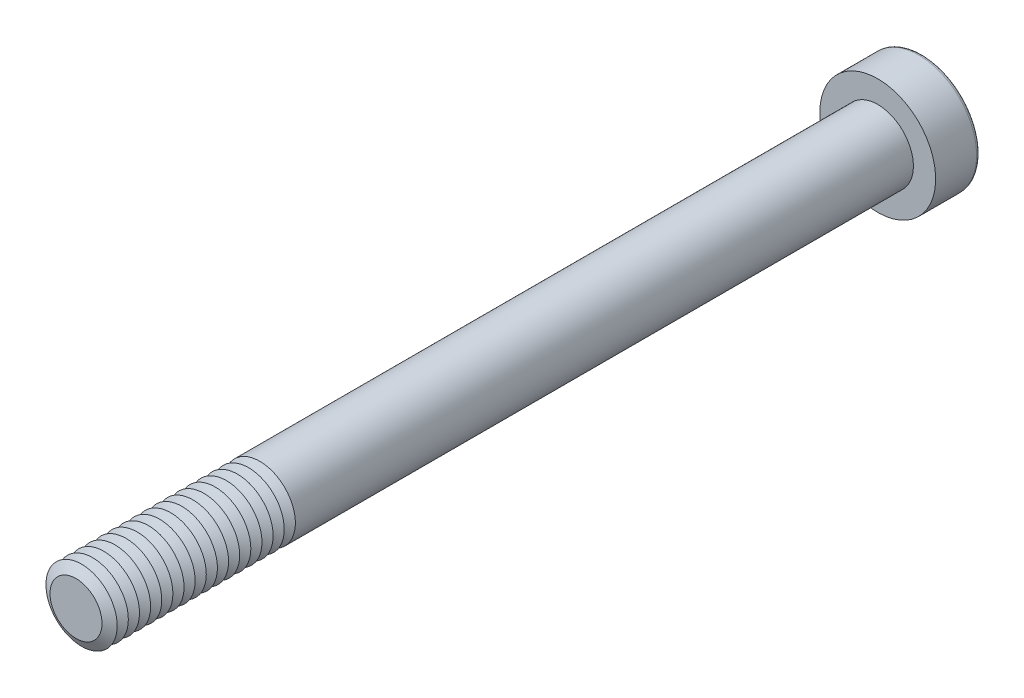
from build123d import *

# Parameters (mm, degrees)
SKETCH1_R           = 4
BOSS_EXTRUDE1_DEPTH = 90
SKETCH2_R           = 6.5
BOSS_EXTRUDE2_DEPTH = 5
CUT_EXTRUDE1_DEPTH  = 3.75
FILLET1_R           = 0.4
LPATTERN1_COUNT     = 17
LPATTERN1_PITCH     = 1.25


with BuildPart() as part:
    # Sketch1 → Boss-Extrude1 (new body)
    with BuildSketch(Plane.XY):
        with Locations(Location((0, 0, 0), (0, 0, 180))):
            Circle(SKETCH1_R)
    extrude(amount=BOSS_EXTRUDE1_DEPTH)

    # Sketch2 → Boss-Extrude2 (add)
    with BuildSketch(Plane(origin=(0, 0, 0), x_dir=(-1, 0, 0), z_dir=(0, 0, -1))):
        Circle(SKETCH2_R)
    extrude(amount=BOSS_EXTRUDE2_DEPTH)

    # Sketch3 → Cut-Extrude1 (cut)
    with BuildSketch(Plane(origin=(0, 0, -5), x_dir=(-1, 0, 0), z_dir=(0, 0, -1))):
        Polygon((-1.443375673, 2.5), (-2.886751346, 0), (-1.443375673, -2.5), (1.443375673, -2.5), (2.886751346, 0), (1.443375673, 2.5), align=None)
    extrude(amount=-CUT_EXTRUDE1_DEPTH, mode=Mode.SUBTRACT)

    # Fillet1
    fillet1_edges = [part.edges().sort_by_distance(p)[0] for p in [
        (6.5, 0, -5),
    ]]
    fillet(fillet1_edges, radius=FILLET1_R)

    # Cut-Extrude2 cone 1 section (on through the dimple's axis) → Cut-Extrude2 (revolve, cut)
    with BuildSketch(Plane(origin=(0, 0, -1.25), x_dir=(0, 1, 0), z_dir=(1, 0, 0))):
        Polygon((0, 0), (2.5, 0), (0, 1.443375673), align=None)
    revolve(axis=Axis((0, 0, -1.25), (0, 0, 1)), mode=Mode.SUBTRACT)

    # Cut-Extrude3 cone 1 section (on through the dimple's axis) → Cut-Extrude3 (revolve, cut)
    with BuildSketch(Plane(origin=(0, 0, -5), x_dir=(0, 1, 0), z_dir=(1, 0, 0))):
        Polygon((0, 0), (2.886751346, 0), (0, 0.773502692), align=None)
    revolve(axis=Axis((0, 0, -5), (0, 0, 1)), mode=Mode.SUBTRACT)

    # Sketch7 → Cut-Revolve1 (revolve, cut)
    with BuildSketch(Plane(origin=(0, 0, 0), x_dir=(0, 0, -1), z_dir=(1, 0, 0)), mode=Mode.PRIVATE) as cut_revolve1_sk:
        Polygon((-90, 2.917468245), (-89.375, 4), (-90.625, 4), align=None)
    cut_revolve1 = revolve(cut_revolve1_sk.sketch.rotate(Axis((0, 0, 90), (0, 0, -1)), 270), axis=Axis((0, 0, 90), (0, 0, -1)), mode=Mode.SUBTRACT)

    # LPattern1: Cut-Revolve1 ×17
    with Locations(*[(0, 0, -i * LPATTERN1_PITCH) for i in range(1, LPATTERN1_COUNT)]):
        add(cut_revolve1, mode=Mode.SUBTRACT)


solid = part.part
